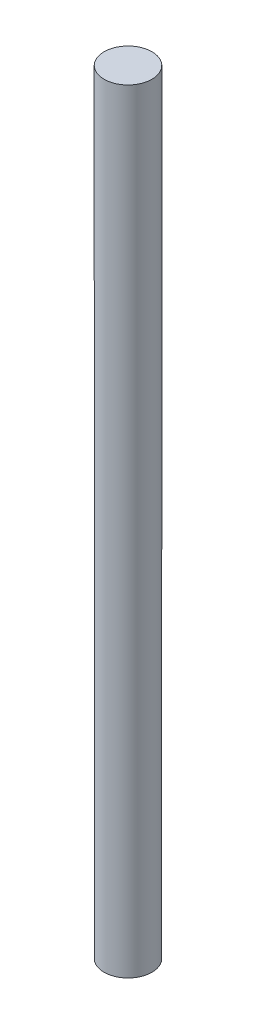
from build123d import *

# Parameters (mm, degrees)
SKETCH1_R           = 6.35
BOSS_EXTRUDE1_DEPTH = 205.58125


with BuildPart() as part:
    # Sketch1 → Boss-Extrude1 (new body)
    with BuildSketch(Plane(origin=(0, 0, 0), x_dir=(1, 0, 0), z_dir=(0, 1, 0))):
        with Locations(Location((0, 0, 0), (0, 0, 90))):
            Circle(SKETCH1_R)
    extrude(amount=BOSS_EXTRUDE1_DEPTH)


solid = part.part
